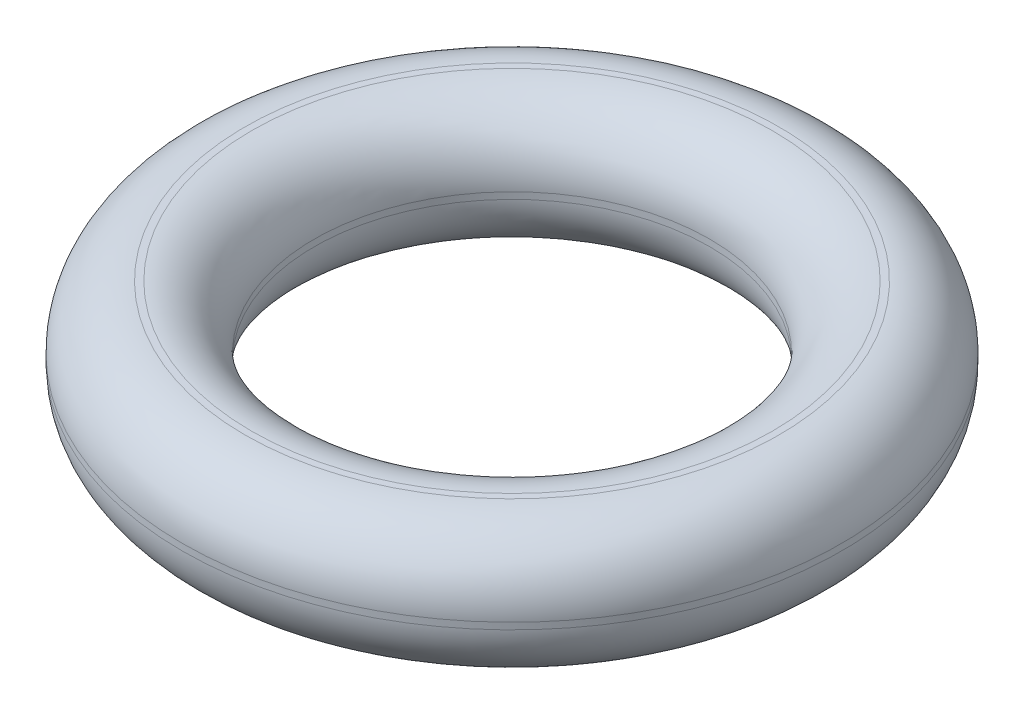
ISO-10303-21;
HEADER;
FILE_DESCRIPTION(('STEP AP214'),'2;1');
FILE_NAME('part.step','',(''),(''),'','','');
FILE_SCHEMA(('AUTOMOTIVE_DESIGN { 1 0 10303 214 1 1 1 1 }'));
ENDSEC;
DATA;
#1=APPLICATION_CONTEXT('core data for automotive mechanical design processes');
#2=APPLICATION_PROTOCOL_DEFINITION('international standard','automotive_design',2000,#1);
#3=PRODUCT_CONTEXT('',#1,'mechanical');
#4=PRODUCT('Part','Part','',(#3));
#5=PRODUCT_RELATED_PRODUCT_CATEGORY('part','',(#4));
#6=PRODUCT_DEFINITION_FORMATION('','',#4);
#7=PRODUCT_DEFINITION_CONTEXT('part definition',#1,'design');
#8=PRODUCT_DEFINITION('design','',#6,#7);
#9=PRODUCT_DEFINITION_SHAPE('','',#8);
#10=(LENGTH_UNIT() NAMED_UNIT(*) SI_UNIT(.MILLI.,.METRE.));
#11=(NAMED_UNIT(*) PLANE_ANGLE_UNIT() SI_UNIT($,.RADIAN.));
#12=(NAMED_UNIT(*) SI_UNIT($,.STERADIAN.) SOLID_ANGLE_UNIT());
#13=UNCERTAINTY_MEASURE_WITH_UNIT(LENGTH_MEASURE(1.E-05),#10,'distance_accuracy_value','');
#14=(GEOMETRIC_REPRESENTATION_CONTEXT(3) GLOBAL_UNCERTAINTY_ASSIGNED_CONTEXT((#13)) GLOBAL_UNIT_ASSIGNED_CONTEXT((#10,
#11,#12)) REPRESENTATION_CONTEXT('',''));
#15=CARTESIAN_POINT('',(0.,0.,0.));
#16=DIRECTION('',(0.,0.,1.));
#17=DIRECTION('',(1.,0.,0.));
#18=AXIS2_PLACEMENT_3D('',#15,#16,#17);
#19=CARTESIAN_POINT('',(0.,1.,0.));
#20=DIRECTION('',(0.,1.,0.));
#21=DIRECTION('',(0.,0.,1.));
#22=AXIS2_PLACEMENT_3D('',#19,#20,#21);
#23=PLANE('',#22);
#24=CARTESIAN_POINT('',(0.,1.,0.));
#25=DIRECTION('',(0.,1.,0.));
#26=DIRECTION('',(0.,0.,1.));
#27=AXIS2_PLACEMENT_3D('',#24,#25,#26);
#28=CIRCLE('',#27,1.975);
#29=CARTESIAN_POINT('',(0.,1.,1.975));
#30=VERTEX_POINT('',#29);
#31=EDGE_CURVE('E10',#30,#30,#28,.F.);
#32=ORIENTED_EDGE('',*,*,#31,.T.);
#33=EDGE_LOOP('',(#32));
#34=FACE_BOUND('',#33,.T.);
#35=CARTESIAN_POINT('',(0.,1.,0.));
#36=DIRECTION('',(0.,1.,0.));
#37=DIRECTION('',(0.,0.,1.));
#38=AXIS2_PLACEMENT_3D('',#35,#36,#37);
#39=CIRCLE('',#38,2.025);
#40=CARTESIAN_POINT('',(0.,1.,2.025));
#41=VERTEX_POINT('',#40);
#42=EDGE_CURVE('E37',#41,#41,#39,.T.);
#43=ORIENTED_EDGE('',*,*,#42,.T.);
#44=EDGE_LOOP('',(#43));
#45=FACE_BOUND('',#44,.T.);
#46=ADVANCED_FACE('F30',(#34,#45),#23,.T.);
#47=CARTESIAN_POINT('',(0.,0.,0.));
#48=DIRECTION('',(0.,1.,0.));
#49=DIRECTION('',(0.,0.,1.));
#50=AXIS2_PLACEMENT_3D('',#47,#48,#49);
#51=PLANE('',#50);
#52=CARTESIAN_POINT('',(0.,0.,0.));
#53=DIRECTION('',(0.,1.,0.));
#54=DIRECTION('',(0.,0.,1.));
#55=AXIS2_PLACEMENT_3D('',#52,#53,#54);
#56=CIRCLE('',#55,1.975);
#57=CARTESIAN_POINT('',(0.,0.,1.975));
#58=VERTEX_POINT('',#57);
#59=EDGE_CURVE('E56',#58,#58,#56,.T.);
#60=ORIENTED_EDGE('',*,*,#59,.T.);
#61=EDGE_LOOP('',(#60));
#62=FACE_BOUND('',#61,.T.);
#63=CARTESIAN_POINT('',(0.,0.,0.));
#64=DIRECTION('',(0.,1.,0.));
#65=DIRECTION('',(0.,0.,1.));
#66=AXIS2_PLACEMENT_3D('',#63,#64,#65);
#67=CIRCLE('',#66,2.025);
#68=CARTESIAN_POINT('',(0.,0.,2.025));
#69=VERTEX_POINT('',#68);
#70=EDGE_CURVE('E59',#69,#69,#67,.F.);
#71=ORIENTED_EDGE('',*,*,#70,.T.);
#72=EDGE_LOOP('',(#71));
#73=FACE_BOUND('',#72,.T.);
#74=ADVANCED_FACE('F63',(#62,#73),#51,.F.);
#75=CARTESIAN_POINT('',(0.,1.,0.));
#76=DIRECTION('',(0.,-1.,0.));
#77=DIRECTION('',(0.,0.,-1.));
#78=AXIS2_PLACEMENT_3D('',#75,#76,#77);
#79=CYLINDRICAL_SURFACE('',#78,2.5);
#80=CARTESIAN_POINT('',(0.,0.475,0.));
#81=DIRECTION('',(0.,1.,0.));
#82=DIRECTION('',(0.,0.,1.));
#83=AXIS2_PLACEMENT_3D('',#80,#81,#82);
#84=CIRCLE('',#83,2.5);
#85=CARTESIAN_POINT('',(0.,0.475,2.5));
#86=VERTEX_POINT('',#85);
#87=EDGE_CURVE('E41',#86,#86,#84,.T.);
#88=ORIENTED_EDGE('',*,*,#87,.T.);
#89=EDGE_LOOP('',(#88));
#90=FACE_BOUND('',#89,.T.);
#91=CARTESIAN_POINT('',(0.,0.525,0.));
#92=DIRECTION('',(0.,1.,0.));
#93=DIRECTION('',(0.,0.,1.));
#94=AXIS2_PLACEMENT_3D('',#91,#92,#93);
#95=CIRCLE('',#94,2.5);
#96=CARTESIAN_POINT('',(0.,0.525,2.5));
#97=VERTEX_POINT('',#96);
#98=EDGE_CURVE('E45',#97,#97,#95,.F.);
#99=ORIENTED_EDGE('',*,*,#98,.T.);
#100=EDGE_LOOP('',(#99));
#101=FACE_BOUND('',#100,.T.);
#102=ADVANCED_FACE('F73',(#90,#101),#79,.T.);
#103=CARTESIAN_POINT('',(0.,1.,0.));
#104=DIRECTION('',(0.,-1.,0.));
#105=DIRECTION('',(0.,0.,-1.));
#106=AXIS2_PLACEMENT_3D('',#103,#104,#105);
#107=CYLINDRICAL_SURFACE('',#106,1.5);
#108=CARTESIAN_POINT('',(0.,0.475,0.));
#109=DIRECTION('',(0.,1.,0.));
#110=DIRECTION('',(0.,0.,1.));
#111=AXIS2_PLACEMENT_3D('',#108,#109,#110);
#112=CIRCLE('',#111,1.5);
#113=CARTESIAN_POINT('',(0.,0.475,1.5));
#114=VERTEX_POINT('',#113);
#115=EDGE_CURVE('E50',#114,#114,#112,.F.);
#116=ORIENTED_EDGE('',*,*,#115,.T.);
#117=EDGE_LOOP('',(#116));
#118=FACE_BOUND('',#117,.T.);
#119=CARTESIAN_POINT('',(0.,0.525,0.));
#120=DIRECTION('',(0.,1.,0.));
#121=DIRECTION('',(0.,0.,1.));
#122=AXIS2_PLACEMENT_3D('',#119,#120,#121);
#123=CIRCLE('',#122,1.5);
#124=CARTESIAN_POINT('',(0.,0.525,1.5));
#125=VERTEX_POINT('',#124);
#126=EDGE_CURVE('E53',#125,#125,#123,.T.);
#127=ORIENTED_EDGE('',*,*,#126,.T.);
#128=EDGE_LOOP('',(#127));
#129=FACE_BOUND('',#128,.T.);
#130=ADVANCED_FACE('F76',(#118,#129),#107,.F.);
#131=CARTESIAN_POINT('',(0.,0.475,0.));
#132=DIRECTION('',(0.,1.,0.));
#133=DIRECTION('',(0.,0.,1.));
#134=AXIS2_PLACEMENT_3D('',#131,#132,#133);
#135=TOROIDAL_SURFACE('',#134,1.975,0.475);
#136=ORIENTED_EDGE('',*,*,#115,.F.);
#137=EDGE_LOOP('',(#136));
#138=FACE_BOUND('',#137,.T.);
#139=ORIENTED_EDGE('',*,*,#59,.F.);
#140=EDGE_LOOP('',(#139));
#141=FACE_BOUND('',#140,.T.);
#142=ADVANCED_FACE('F69',(#138,#141),#135,.T.);
#143=CARTESIAN_POINT('',(0.,0.475,0.));
#144=DIRECTION('',(0.,1.,0.));
#145=DIRECTION('',(0.,0.,1.));
#146=AXIS2_PLACEMENT_3D('',#143,#144,#145);
#147=TOROIDAL_SURFACE('',#146,2.025,0.475);
#148=ORIENTED_EDGE('',*,*,#70,.F.);
#149=EDGE_LOOP('',(#148));
#150=FACE_BOUND('',#149,.T.);
#151=ORIENTED_EDGE('',*,*,#87,.F.);
#152=EDGE_LOOP('',(#151));
#153=FACE_BOUND('',#152,.T.);
#154=ADVANCED_FACE('F65',(#150,#153),#147,.T.);
#155=CARTESIAN_POINT('',(0.,0.525,0.));
#156=DIRECTION('',(0.,1.,0.));
#157=DIRECTION('',(0.,0.,1.));
#158=AXIS2_PLACEMENT_3D('',#155,#156,#157);
#159=TOROIDAL_SURFACE('',#158,1.975,0.475);
#160=ORIENTED_EDGE('',*,*,#31,.F.);
#161=EDGE_LOOP('',(#160));
#162=FACE_BOUND('',#161,.T.);
#163=ORIENTED_EDGE('',*,*,#126,.F.);
#164=EDGE_LOOP('',(#163));
#165=FACE_BOUND('',#164,.T.);
#166=ADVANCED_FACE('F68',(#162,#165),#159,.T.);
#167=CARTESIAN_POINT('',(0.,0.525,0.));
#168=DIRECTION('',(0.,1.,0.));
#169=DIRECTION('',(0.,0.,1.));
#170=AXIS2_PLACEMENT_3D('',#167,#168,#169);
#171=TOROIDAL_SURFACE('',#170,2.025,0.475);
#172=ORIENTED_EDGE('',*,*,#98,.F.);
#173=EDGE_LOOP('',(#172));
#174=FACE_BOUND('',#173,.T.);
#175=ORIENTED_EDGE('',*,*,#42,.F.);
#176=EDGE_LOOP('',(#175));
#177=FACE_BOUND('',#176,.T.);
#178=ADVANCED_FACE('F32',(#174,#177),#171,.T.);
#179=CLOSED_SHELL('',(#46,#74,#102,#130,#142,#154,#166,#178));
#180=MANIFOLD_SOLID_BREP('B2',#179);
#181=ADVANCED_BREP_SHAPE_REPRESENTATION('',(#18,#180),#14);
#182=SHAPE_DEFINITION_REPRESENTATION(#9,#181);
ENDSEC;
END-ISO-10303-21;
